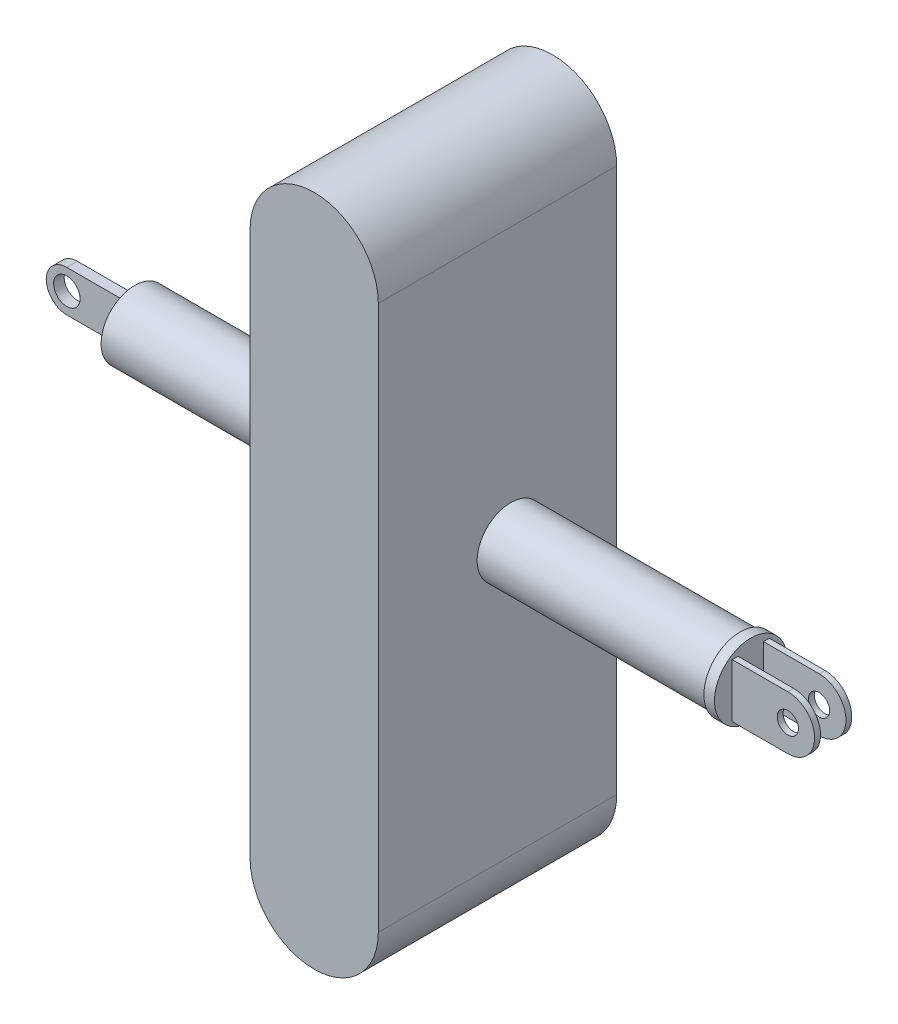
from build123d import *

# Parameters (mm, degrees)
SKETCH1_R               = 12.7
EXTRUDE1_DEPTH          = 228.6
SKETCH2_R               = 5
EXTRUDE2_DEPTH          = 2
SKETCH3_R               = 13.7
EXTRUDE3_DEPTH          = 4
SKETCH4_R               = 4
EXTRUDE4_DEPTH          = 7
CUT_EXTRUDE1_DEPTH      = 265.443561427
CUT_EXTRUDE1_DEPTH_BACK = 265.443561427
SKETCH5_W               = 127.127972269
SKETCH5_H               = 9.602426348
EXTRUDE5_DEPTH          = 50
EXTRUDE5_DEPTH_BACK     = 40


with BuildPart() as part:
    # Sketch1 → Extrude1 (new body)
    with BuildSketch(Plane(origin=(0, 0, 0), x_dir=(0, 0, -1), z_dir=(1, 0, 0))):
        with Locations(Location((0, 0, 0), (0, 0, 180))):
            Circle(SKETCH1_R)
    extrude(amount=EXTRUDE1_DEPTH)

    # Sketch2 → Extrude2 (add, symmetric)
    with BuildSketch(Plane.XY):
        with BuildLine():
            Line((0, 7.778067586), (-23.625125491, 7.778067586))
            ThreePointArc((-23.625125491, 7.778067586), (-31.403193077, 0), (-23.625125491, -7.778067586))
            Line((-23.625125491, -7.778067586), (0, -7.778067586))
            Line((0, -7.778067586), (0, 7.778067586))
        make_face()
        with Locations((-23.625125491, 0)):
            Circle(SKETCH2_R, mode=Mode.SUBTRACT)
    extrude(amount=EXTRUDE2_DEPTH, both=True)

    # Sketch3 → Extrude3 (add)
    with BuildSketch(Plane(origin=(228.6, 0, 0), x_dir=(0, 0, -1), z_dir=(1, 0, 0))):
        Circle(SKETCH3_R)
    extrude(amount=EXTRUDE3_DEPTH)

    # Sketch4 → Extrude4 (add, symmetric)
    with BuildSketch(Plane.XY):
        with BuildLine():
            Line((232.6, 10.132851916), (253.6, 10.132851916))
            ThreePointArc((253.6, 10.132851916), (263.732851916, 0), (253.6, -10.132851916))
            Line((253.6, -10.132851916), (232.6, -10.132851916))
            Line((232.6, -10.132851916), (232.6, 10.132851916))
        make_face()
        with Locations((253.6, 0)):
            Circle(SKETCH4_R, mode=Mode.SUBTRACT)
    extrude(amount=EXTRUDE4_DEPTH, both=True)

    # Sketch5 → Cut-Extrude1 (cut, two sides: drawn at the far end of the back side and taken through both)
    with BuildSketch(Plane(origin=(0, 0, 0), x_dir=(1, 0, 0), z_dir=(0, 1, 0)).offset(-CUT_EXTRUDE1_DEPTH_BACK)):
        with Locations((296.163986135, 0)):
            Rectangle(SKETCH5_W, SKETCH5_H)
    extrude(amount=CUT_EXTRUDE1_DEPTH + CUT_EXTRUDE1_DEPTH_BACK, mode=Mode.SUBTRACT)

    # Sketch6 → Extrude5 (add, two sides: drawn at the far end of the back side and taken through both)
    with BuildSketch(Plane.XY.offset(-EXTRUDE5_DEPTH_BACK)):
        with BuildLine():
            Line((93.560706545, 102.813659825), (93.560706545, 0))
            Line((93.560706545, 0), (141.979005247, 0))
            Line((141.979005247, 0), (141.979005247, 102.813659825))
            ThreePointArc((141.979005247, 102.813659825), (117.769855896, 127.022809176), (93.560706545, 102.813659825))
        make_face()
        with BuildLine():
            Line((141.979005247, 0), (93.560706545, 0))
            Line((93.560706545, 0), (93.560706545, -102.813659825))
            ThreePointArc((93.560706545, -102.813659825), (117.769855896, -127.022809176), (141.979005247, -102.813659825))
            Line((141.979005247, -102.813659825), (141.979005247, 0))
        make_face()
    extrude(amount=EXTRUDE5_DEPTH + EXTRUDE5_DEPTH_BACK)


solid = part.part
